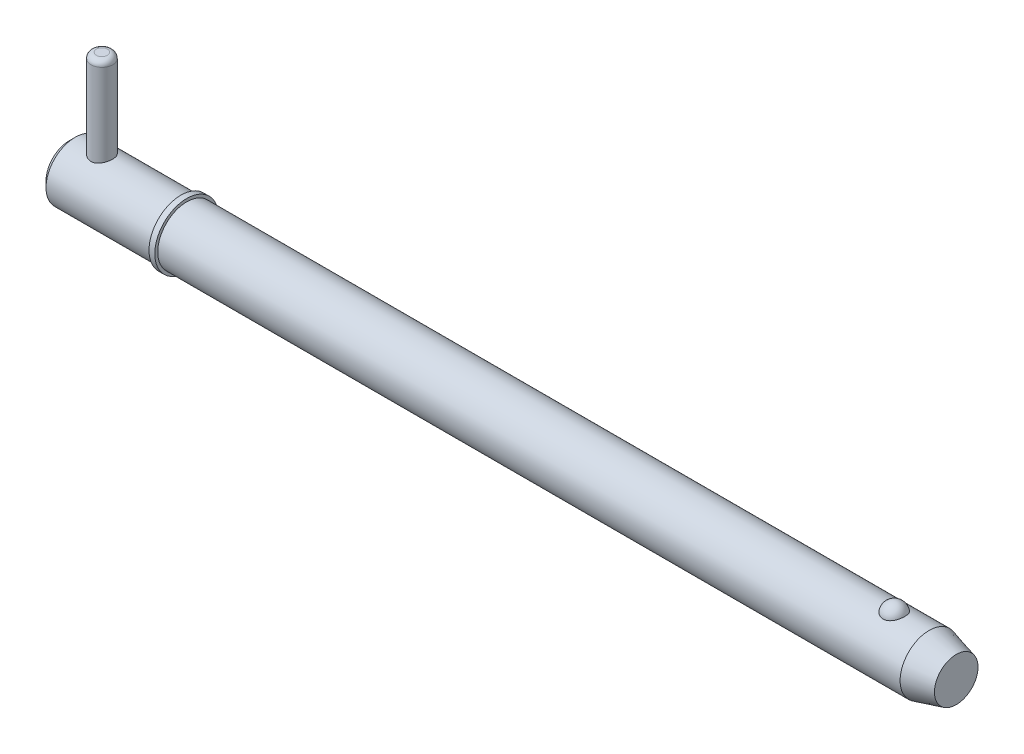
ISO-10303-21;
HEADER;
FILE_DESCRIPTION(('STEP AP214'),'2;1');
FILE_NAME('part.step','',(''),(''),'','','');
FILE_SCHEMA(('AUTOMOTIVE_DESIGN { 1 0 10303 214 1 1 1 1 }'));
ENDSEC;
DATA;
#1=APPLICATION_CONTEXT('core data for automotive mechanical design processes');
#2=APPLICATION_PROTOCOL_DEFINITION('international standard','automotive_design',2000,#1);
#3=PRODUCT_CONTEXT('',#1,'mechanical');
#4=PRODUCT('Part','Part','',(#3));
#5=PRODUCT_RELATED_PRODUCT_CATEGORY('part','',(#4));
#6=PRODUCT_DEFINITION_FORMATION('','',#4);
#7=PRODUCT_DEFINITION_CONTEXT('part definition',#1,'design');
#8=PRODUCT_DEFINITION('design','',#6,#7);
#9=PRODUCT_DEFINITION_SHAPE('','',#8);
#10=(LENGTH_UNIT() NAMED_UNIT(*) SI_UNIT(.MILLI.,.METRE.));
#11=(NAMED_UNIT(*) PLANE_ANGLE_UNIT() SI_UNIT($,.RADIAN.));
#12=(NAMED_UNIT(*) SI_UNIT($,.STERADIAN.) SOLID_ANGLE_UNIT());
#13=UNCERTAINTY_MEASURE_WITH_UNIT(LENGTH_MEASURE(1.E-05),#10,'distance_accuracy_value','');
#14=(GEOMETRIC_REPRESENTATION_CONTEXT(3) GLOBAL_UNCERTAINTY_ASSIGNED_CONTEXT((#13)) GLOBAL_UNIT_ASSIGNED_CONTEXT((#10,
#11,#12)) REPRESENTATION_CONTEXT('',''));
#15=CARTESIAN_POINT('',(0.,0.,0.));
#16=DIRECTION('',(0.,0.,1.));
#17=DIRECTION('',(1.,0.,0.));
#18=AXIS2_PLACEMENT_3D('',#15,#16,#17);
#19=CARTESIAN_POINT('',(7.14,25.4,0.));
#20=DIRECTION('',(0.,-1.,0.));
#21=DIRECTION('',(0.,0.,-1.));
#22=AXIS2_PLACEMENT_3D('',#19,#20,#21);
#23=CYLINDRICAL_SURFACE('',#22,2.38);
#24=CARTESIAN_POINT('',(7.14,-5.16,0.));
#25=DIRECTION('',(0.,1.,0.));
#26=DIRECTION('',(0.,0.,1.));
#27=AXIS2_PLACEMENT_3D('',#24,#25,#26);
#28=CIRCLE('',#27,2.38);
#29=CARTESIAN_POINT('',(7.14,-5.16,2.38));
#30=VERTEX_POINT('',#29);
#31=EDGE_CURVE('P0_E25',#30,#30,#28,.T.);
#32=ORIENTED_EDGE('',*,*,#31,.T.);
#33=EDGE_LOOP('',(#32));
#34=FACE_BOUND('',#33,.T.);
#35=CARTESIAN_POINT('',(7.14,24.21,0.));
#36=DIRECTION('',(0.,1.,0.));
#37=DIRECTION('',(0.,0.,1.));
#38=AXIS2_PLACEMENT_3D('',#35,#36,#37);
#39=CIRCLE('',#38,2.38);
#40=CARTESIAN_POINT('',(7.14,24.21,2.38));
#41=VERTEX_POINT('',#40);
#42=EDGE_CURVE('P0_E29',#41,#41,#39,.F.);
#43=ORIENTED_EDGE('',*,*,#42,.T.);
#44=EDGE_LOOP('',(#43));
#45=FACE_BOUND('',#44,.T.);
#46=ADVANCED_FACE('P0_F14',(#34,#45),#23,.T.);
#47=CARTESIAN_POINT('',(7.14,25.4,0.));
#48=DIRECTION('',(0.,1.,0.));
#49=DIRECTION('',(0.,0.,1.));
#50=AXIS2_PLACEMENT_3D('',#47,#48,#49);
#51=PLANE('',#50);
#52=CARTESIAN_POINT('',(7.14,25.4,0.));
#53=DIRECTION('',(0.,1.,0.));
#54=DIRECTION('',(0.,0.,1.));
#55=AXIS2_PLACEMENT_3D('',#52,#53,#54);
#56=CIRCLE('',#55,1.19);
#57=CARTESIAN_POINT('',(7.14,25.4,1.19));
#58=VERTEX_POINT('',#57);
#59=EDGE_CURVE('P0_E10',#58,#58,#56,.T.);
#60=ORIENTED_EDGE('',*,*,#59,.T.);
#61=EDGE_LOOP('',(#60));
#62=FACE_BOUND('',#61,.T.);
#63=ADVANCED_FACE('P0_F46',(#62),#51,.T.);
#64=CARTESIAN_POINT('',(7.14,-6.35,0.));
#65=DIRECTION('',(0.,1.,0.));
#66=DIRECTION('',(0.,0.,1.));
#67=AXIS2_PLACEMENT_3D('',#64,#65,#66);
#68=PLANE('',#67);
#69=CARTESIAN_POINT('',(7.14,-6.35,0.));
#70=DIRECTION('',(0.,1.,0.));
#71=DIRECTION('',(0.,0.,1.));
#72=AXIS2_PLACEMENT_3D('',#69,#70,#71);
#73=CIRCLE('',#72,1.19);
#74=CARTESIAN_POINT('',(7.14,-6.35,1.19));
#75=VERTEX_POINT('',#74);
#76=EDGE_CURVE('P0_E21',#75,#75,#73,.F.);
#77=ORIENTED_EDGE('',*,*,#76,.T.);
#78=EDGE_LOOP('',(#77));
#79=FACE_BOUND('',#78,.T.);
#80=ADVANCED_FACE('P0_F43',(#79),#68,.F.);
#81=CARTESIAN_POINT('',(7.14,-5.16,0.));
#82=DIRECTION('',(0.,1.,0.));
#83=DIRECTION('',(0.,0.,1.));
#84=AXIS2_PLACEMENT_3D('',#81,#82,#83);
#85=DEGENERATE_TOROIDAL_SURFACE('',#84,1.19,1.19,.T.);
#86=ORIENTED_EDGE('',*,*,#76,.F.);
#87=EDGE_LOOP('',(#86));
#88=FACE_BOUND('',#87,.T.);
#89=ORIENTED_EDGE('',*,*,#31,.F.);
#90=EDGE_LOOP('',(#89));
#91=FACE_BOUND('',#90,.T.);
#92=ADVANCED_FACE('P0_F38',(#88,#91),#85,.T.);
#93=CARTESIAN_POINT('',(7.14,24.21,0.));
#94=DIRECTION('',(0.,1.,0.));
#95=DIRECTION('',(0.,0.,1.));
#96=AXIS2_PLACEMENT_3D('',#93,#94,#95);
#97=DEGENERATE_TOROIDAL_SURFACE('',#96,1.19,1.19,.T.);
#98=ORIENTED_EDGE('',*,*,#42,.F.);
#99=EDGE_LOOP('',(#98));
#100=FACE_BOUND('',#99,.T.);
#101=ORIENTED_EDGE('',*,*,#59,.F.);
#102=EDGE_LOOP('',(#101));
#103=FACE_BOUND('',#102,.T.);
#104=ADVANCED_FACE('P0_F16',(#100,#103),#97,.T.);
#105=CLOSED_SHELL('',(#46,#63,#80,#92,#104));
#106=MANIFOLD_SOLID_BREP('P0_B1',#105);
#107=CARTESIAN_POINT('',(0.,0.,0.));
#108=DIRECTION('',(1.,0.,0.));
#109=DIRECTION('',(0.,0.,-1.));
#110=AXIS2_PLACEMENT_3D('',#107,#108,#109);
#111=CYLINDRICAL_SURFACE('',#110,6.35);
#112=CARTESIAN_POINT('',(188.055369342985,0.,0.));
#113=DIRECTION('',(1.,0.,0.));
#114=DIRECTION('',(0.,0.,-1.));
#115=AXIS2_PLACEMENT_3D('',#112,#113,#114);
#116=CIRCLE('',#115,6.35);
#117=CARTESIAN_POINT('',(188.055369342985,0.,-6.35));
#118=VERTEX_POINT('',#117);
#119=EDGE_CURVE('P1_E81',#118,#118,#116,.T.);
#120=ORIENTED_EDGE('',*,*,#119,.F.);
#121=EDGE_LOOP('',(#120));
#122=FACE_BOUND('',#121,.T.);
#123=CARTESIAN_POINT('',(25.7,0.,0.));
#124=DIRECTION('',(1.,0.,0.));
#125=DIRECTION('',(0.,0.,-1.));
#126=AXIS2_PLACEMENT_3D('',#123,#124,#125);
#127=CIRCLE('',#126,6.35);
#128=CARTESIAN_POINT('',(25.7,0.,-6.35));
#129=VERTEX_POINT('',#128);
#130=EDGE_CURVE('P1_E85',#129,#129,#127,.T.);
#131=ORIENTED_EDGE('',*,*,#130,.T.);
#132=EDGE_LOOP('',(#131));
#133=FACE_BOUND('',#132,.T.);
#134=CARTESIAN_POINT('',(180.430021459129,5.87502187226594,2.40969251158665));
#135=CARTESIAN_POINT('',(180.305030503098,5.87501645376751,2.40969773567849));
#136=CARTESIAN_POINT('',(180.180080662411,5.87916061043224,2.39967292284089));
#137=CARTESIAN_POINT('',(179.933909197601,5.89523112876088,2.35991730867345));
#138=CARTESIAN_POINT('',(179.812686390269,5.90715499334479,2.33019283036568));
#139=CARTESIAN_POINT('',(179.577517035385,5.93739567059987,2.25201402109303));
#140=CARTESIAN_POINT('',(179.463560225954,5.95570321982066,2.20358681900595));
#141=CARTESIAN_POINT('',(179.24557352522,5.9967206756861,2.08937987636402));
#142=CARTESIAN_POINT('',(179.141545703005,6.0194314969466,2.02359652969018));
#143=CARTESIAN_POINT('',(178.942943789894,6.06760647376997,1.87428969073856));
#144=CARTESIAN_POINT('',(178.848726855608,6.09313095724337,1.79031110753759));
#145=CARTESIAN_POINT('',(178.675255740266,6.14375873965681,1.60800178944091));
#146=CARTESIAN_POINT('',(178.596004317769,6.16886196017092,1.50966841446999));
#147=CARTESIAN_POINT('',(178.450845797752,6.21724600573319,1.29645884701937));
#148=CARTESIAN_POINT('',(178.385688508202,6.24039621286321,1.1810415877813));
#149=CARTESIAN_POINT('',(178.274703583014,6.28117277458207,0.940351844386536));
#150=CARTESIAN_POINT('',(178.228877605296,6.29879865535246,0.815078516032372));
#151=CARTESIAN_POINT('',(178.157023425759,6.32692073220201,0.556494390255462));
#152=CARTESIAN_POINT('',(178.131249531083,6.33732517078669,0.423102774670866));
#153=CARTESIAN_POINT('',(178.100988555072,6.34957673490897,0.153542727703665));
#154=CARTESIAN_POINT('',(178.096500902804,6.35142408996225,0.0173743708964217));
#155=CARTESIAN_POINT('',(178.108865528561,6.34638925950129,-0.25303667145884));
#156=CARTESIAN_POINT('',(178.125594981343,6.33955731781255,-0.387285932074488));
#157=CARTESIAN_POINT('',(178.179843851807,6.31794129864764,-0.650851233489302));
#158=CARTESIAN_POINT('',(178.217363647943,6.3031570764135,-0.780167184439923));
#159=CARTESIAN_POINT('',(178.312500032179,6.26711642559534,-1.03041949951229));
#160=CARTESIAN_POINT('',(178.370143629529,6.24585130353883,-1.15134433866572));
#161=CARTESIAN_POINT('',(178.504352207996,6.19905619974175,-1.38129800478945));
#162=CARTESIAN_POINT('',(178.580918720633,6.17352587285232,-1.49032586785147));
#163=CARTESIAN_POINT('',(178.751753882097,6.12080227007,-1.69393164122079));
#164=CARTESIAN_POINT('',(178.846100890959,6.09360200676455,-1.78844209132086));
#165=CARTESIAN_POINT('',(179.050119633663,6.04070434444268,-1.95970536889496));
#166=CARTESIAN_POINT('',(179.159790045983,6.015006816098,-2.0364597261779));
#167=CARTESIAN_POINT('',(179.389187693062,5.96867714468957,-2.16845644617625));
#168=CARTESIAN_POINT('',(179.508652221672,5.94794910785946,-2.22412062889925));
#169=CARTESIAN_POINT('',(179.756218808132,5.91340580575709,-2.31440992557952));
#170=CARTESIAN_POINT('',(179.884317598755,5.89958794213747,-2.34904294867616));
#171=CARTESIAN_POINT('',(180.138582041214,5.88111049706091,-2.39491590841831));
#172=CARTESIAN_POINT('',(180.264520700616,5.87602512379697,-2.40724512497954));
#173=CARTESIAN_POINT('',(180.516786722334,5.87428980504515,-2.41147867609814));
#174=CARTESIAN_POINT('',(180.643114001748,5.8776381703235,-2.40338710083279));
#175=CARTESIAN_POINT('',(180.888417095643,5.89212921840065,-2.36762715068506));
#176=CARTESIAN_POINT('',(181.007499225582,5.90302431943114,-2.3405803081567));
#177=CARTESIAN_POINT('',(181.23924472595,5.93113752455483,-2.26839066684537));
#178=CARTESIAN_POINT('',(181.351907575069,5.94835614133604,-2.22324640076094));
#179=CARTESIAN_POINT('',(181.570400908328,5.9877301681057,-2.11493806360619));
#180=CARTESIAN_POINT('',(181.676028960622,6.00998499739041,-2.05140269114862));
#181=CARTESIAN_POINT('',(181.875300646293,6.05690144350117,-1.90842705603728));
#182=CARTESIAN_POINT('',(181.968941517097,6.08156361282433,-1.82898313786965));
#183=CARTESIAN_POINT('',(182.146675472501,6.13211715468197,-1.65182429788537));
#184=CARTESIAN_POINT('',(182.230055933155,6.15800825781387,-1.55339381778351));
#185=CARTESIAN_POINT('',(182.379790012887,6.20712834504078,-1.34374214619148));
#186=CARTESIAN_POINT('',(182.446140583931,6.23035685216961,-1.23251867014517));
#187=CARTESIAN_POINT('',(182.562345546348,6.27251177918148,-0.996447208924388));
#188=CARTESIAN_POINT('',(182.611607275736,6.29127762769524,-0.871278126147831));
#189=CARTESIAN_POINT('',(182.689614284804,6.3215862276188,-0.613870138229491));
#190=CARTESIAN_POINT('',(182.718359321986,6.33312889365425,-0.481631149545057));
#191=CARTESIAN_POINT('',(182.754770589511,6.34782349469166,-0.213672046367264));
#192=CARTESIAN_POINT('',(182.762413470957,6.35096613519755,-0.0779482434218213));
#193=CARTESIAN_POINT('',(182.756395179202,6.34851322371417,0.192943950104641));
#194=CARTESIAN_POINT('',(182.742734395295,6.3429178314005,0.328112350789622));
#195=CARTESIAN_POINT('',(182.69450361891,6.32360512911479,0.593406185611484));
#196=CARTESIAN_POINT('',(182.660031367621,6.30992579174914,0.723552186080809));
#197=CARTESIAN_POINT('',(182.570953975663,6.27586325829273,0.97583417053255));
#198=CARTESIAN_POINT('',(182.51634761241,6.25547965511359,1.09796966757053));
#199=CARTESIAN_POINT('',(182.38775879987,6.20998183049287,1.33148921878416));
#200=CARTESIAN_POINT('',(182.313674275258,6.18484288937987,1.44281227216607));
#201=CARTESIAN_POINT('',(182.147820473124,6.13258735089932,1.65087683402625));
#202=CARTESIAN_POINT('',(182.056051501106,6.10547078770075,1.7476185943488));
#203=CARTESIAN_POINT('',(181.857183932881,6.05235879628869,1.92350926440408));
#204=CARTESIAN_POINT('',(181.750133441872,6.02636017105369,2.00271146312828));
#205=CARTESIAN_POINT('',(181.523138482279,5.97843747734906,2.14154159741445));
#206=CARTESIAN_POINT('',(181.403191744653,5.9565141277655,2.20116608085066));
#207=CARTESIAN_POINT('',(181.144523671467,5.91812106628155,2.30250570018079));
#208=CARTESIAN_POINT('',(181.00506980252,5.90217533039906,2.34256795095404));
#209=CARTESIAN_POINT('',(180.720397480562,5.88063128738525,2.3961521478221));
#210=CARTESIAN_POINT('',(180.57518174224,5.87502816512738,2.40968644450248));
#211=CARTESIAN_POINT('',(180.430021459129,5.87502187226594,2.40969251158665));
#212=B_SPLINE_CURVE_WITH_KNOTS('',3,(#134,#135,#136,#137,#138,#139,#140,#141,#142,#143,#144,
#145,#146,#147,#148,#149,#150,#151,#152,#153,#154,#155,#156,#157,#158,#159,#160,#161,#162,#163,
#164,#165,#166,#167,#168,#169,#170,#171,#172,#173,#174,#175,#176,#177,#178,#179,#180,#181,#182,
#183,#184,#185,#186,#187,#188,#189,#190,#191,#192,#193,#194,#195,#196,#197,#198,#199,#200,#201,
#202,#203,#204,#205,#206,#207,#208,#209,#210,#211),.UNSPECIFIED.,.T.,.F.,(4,2,2,2,2,2,2,2,2,2,2,
2,2,2,2,2,2,2,2,2,2,2,2,2,2,2,2,2,2,2,2,2,2,2,2,2,2,2,4),(0.,0.374440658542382,
0.748761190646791,1.12254078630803,1.4963981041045,1.88098871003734,2.26565013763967,
2.66741104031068,3.06920639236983,3.47601794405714,3.88281858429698,4.28727498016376,
4.69173873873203,5.09674745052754,5.50178895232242,5.90865911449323,6.31549420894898,
6.71369855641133,7.11175305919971,7.48978077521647,7.86773278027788,8.23383886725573,
8.59997464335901,8.97409044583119,9.34829231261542,9.74122667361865,10.1342313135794,
10.5397522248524,10.9452779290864,11.3512521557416,11.75721896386,12.1612938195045,
12.5653932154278,12.9716540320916,13.3779078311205,13.7829098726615,14.1879832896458,
14.6230486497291,15.0579114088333),.UNSPECIFIED.);
#213=CARTESIAN_POINT('',(180.430021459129,5.87502187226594,2.40969251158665));
#214=VERTEX_POINT('',#213);
#215=EDGE_CURVE('P1_E35',#214,#214,#212,.T.);
#216=ORIENTED_EDGE('',*,*,#215,.T.);
#217=EDGE_LOOP('',(#216));
#218=FACE_BOUND('',#217,.T.);
#219=ADVANCED_FACE('P1_F13',(#122,#133,#218),#111,.T.);
#220=CARTESIAN_POINT('',(0.,0.,0.));
#221=DIRECTION('',(-1.,0.,0.));
#222=DIRECTION('',(0.,0.,1.));
#223=AXIS2_PLACEMENT_3D('',#220,#221,#222);
#224=PLANE('',#223);
#225=CARTESIAN_POINT('',(0.,0.,0.));
#226=DIRECTION('',(1.,0.,0.));
#227=DIRECTION('',(0.,0.,-1.));
#228=AXIS2_PLACEMENT_3D('',#225,#226,#227);
#229=CIRCLE('',#228,5.08);
#230=CARTESIAN_POINT('',(0.,0.,-5.08));
#231=VERTEX_POINT('',#230);
#232=EDGE_CURVE('P1_E9',#231,#231,#229,.T.);
#233=ORIENTED_EDGE('',*,*,#232,.F.);
#234=EDGE_LOOP('',(#233));
#235=FACE_BOUND('',#234,.T.);
#236=ADVANCED_FACE('P1_F15',(#235),#224,.T.);
#237=CARTESIAN_POINT('',(1.27,0.,0.));
#238=DIRECTION('',(1.,0.,0.));
#239=DIRECTION('',(0.,0.,-1.));
#240=AXIS2_PLACEMENT_3D('',#237,#238,#239);
#241=CONICAL_SURFACE('',#240,6.35,0.78539816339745);
#242=ORIENTED_EDGE('',*,*,#232,.T.);
#243=EDGE_LOOP('',(#242));
#244=FACE_BOUND('',#243,.T.);
#245=CARTESIAN_POINT('',(1.27,0.,0.));
#246=DIRECTION('',(1.,0.,0.));
#247=DIRECTION('',(0.,0.,-1.));
#248=AXIS2_PLACEMENT_3D('',#245,#246,#247);
#249=CIRCLE('',#248,6.35);
#250=CARTESIAN_POINT('',(1.27,0.,-6.35));
#251=VERTEX_POINT('',#250);
#252=EDGE_CURVE('P1_E26',#251,#251,#249,.T.);
#253=ORIENTED_EDGE('',*,*,#252,.F.);
#254=EDGE_LOOP('',(#253));
#255=FACE_BOUND('',#254,.T.);
#256=ADVANCED_FACE('P1_F77',(#244,#255),#241,.T.);
#257=CARTESIAN_POINT('',(0.,0.,0.));
#258=DIRECTION('',(1.,0.,0.));
#259=DIRECTION('',(0.,0.,-1.));
#260=AXIS2_PLACEMENT_3D('',#257,#258,#259);
#261=CYLINDRICAL_SURFACE('',#260,6.35);
#262=CARTESIAN_POINT('',(7.14,-5.88711304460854,2.38));
#263=CARTESIAN_POINT('',(7.01146258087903,-5.88710856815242,2.38000480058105));
#264=CARTESIAN_POINT('',(6.88295682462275,-5.89136840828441,2.36955244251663));
#265=CARTESIAN_POINT('',(6.62981934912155,-5.90782785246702,2.32820953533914));
#266=CARTESIAN_POINT('',(6.50518751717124,-5.92002722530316,2.29731958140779));
#267=CARTESIAN_POINT('',(6.26352403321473,-5.95079384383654,2.21639366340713));
#268=CARTESIAN_POINT('',(6.14647496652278,-5.96934583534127,2.16640353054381));
#269=CARTESIAN_POINT('',(5.92237941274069,-6.01070278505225,2.04885862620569));
#270=CARTESIAN_POINT('',(5.81533593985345,-6.03350901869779,1.98129858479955));
#271=CARTESIAN_POINT('',(5.60897525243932,-6.08207341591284,1.82693902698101));
#272=CARTESIAN_POINT('',(5.51022503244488,-6.10791836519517,1.73940861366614));
#273=CARTESIAN_POINT('',(5.32840561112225,-6.15892405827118,1.54914379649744));
#274=CARTESIAN_POINT('',(5.24533975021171,-6.1840846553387,1.44640616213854));
#275=CARTESIAN_POINT('',(5.09451639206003,-6.23191821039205,1.22434014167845));
#276=CARTESIAN_POINT('',(5.02737511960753,-6.25447755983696,1.10456656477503));
#277=CARTESIAN_POINT('',(4.91443001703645,-6.2935236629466,0.854429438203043));
#278=CARTESIAN_POINT('',(4.86861879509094,-6.31001251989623,0.724069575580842));
#279=CARTESIAN_POINT('',(4.80162253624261,-6.33444370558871,0.46242122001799));
#280=CARTESIAN_POINT('',(4.77946137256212,-6.34272370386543,0.331414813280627));
#281=CARTESIAN_POINT('',(4.75726677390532,-6.35101600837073,0.0672982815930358));
#282=CARTESIAN_POINT('',(4.75722615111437,-6.35103100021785,-0.0658111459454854));
#283=CARTESIAN_POINT('',(4.77870510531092,-6.3430064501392,-0.323358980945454));
#284=CARTESIAN_POINT('',(4.79915922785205,-6.33536494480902,-0.447900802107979));
#285=CARTESIAN_POINT('',(4.85925493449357,-6.31340794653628,-0.69163609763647));
#286=CARTESIAN_POINT('',(4.89889787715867,-6.29909198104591,-0.810829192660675));
#287=CARTESIAN_POINT('',(4.9967414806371,-6.26494471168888,-1.04254212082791));
#288=CARTESIAN_POINT('',(5.05520370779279,-6.24503620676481,-1.1549396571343));
#289=CARTESIAN_POINT('',(5.1887948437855,-6.20171869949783,-1.3686079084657));
#290=CARTESIAN_POINT('',(5.26392912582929,-6.17830856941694,-1.46987502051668));
#291=CARTESIAN_POINT('',(5.43386591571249,-6.12878580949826,-1.66468415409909));
#292=CARTESIAN_POINT('',(5.52956139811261,-6.10259519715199,-1.75742857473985));
#293=CARTESIAN_POINT('',(5.73530435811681,-6.05155777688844,-1.92585331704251));
#294=CARTESIAN_POINT('',(5.84535542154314,-6.02671130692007,-2.00152936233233));
#295=CARTESIAN_POINT('',(6.07982989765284,-5.98068420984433,-2.13519109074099));
#296=CARTESIAN_POINT('',(6.20451768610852,-5.95959698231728,-2.19274775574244));
#297=CARTESIAN_POINT('',(6.4628145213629,-5.92455622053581,-2.28574558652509));
#298=CARTESIAN_POINT('',(6.59641856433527,-5.91059872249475,-2.32119904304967));
#299=CARTESIAN_POINT('',(6.86087441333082,-5.8923327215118,-2.36717069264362));
#300=CARTESIAN_POINT('',(6.99147192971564,-5.8875347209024,-2.37895573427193));
#301=CARTESIAN_POINT('',(7.25283805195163,-5.88674545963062,-2.38091046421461));
#302=CARTESIAN_POINT('',(7.38360660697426,-5.89075200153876,-2.37108554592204));
#303=CARTESIAN_POINT('',(7.63510696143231,-5.90662331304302,-2.33124781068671));
#304=CARTESIAN_POINT('',(7.75602069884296,-5.91810660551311,-2.30221396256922));
#305=CARTESIAN_POINT('',(7.99120505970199,-5.94718527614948,-2.22601401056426));
#306=CARTESIAN_POINT('',(8.10547431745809,-5.96478190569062,-2.17884419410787));
#307=CARTESIAN_POINT('',(8.32888632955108,-6.00491533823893,-2.06572311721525));
#308=CARTESIAN_POINT('',(8.43767672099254,-6.02761250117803,-1.99913452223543));
#309=CARTESIAN_POINT('',(8.6429894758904,-6.07511988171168,-1.84974438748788));
#310=CARTESIAN_POINT('',(8.73950733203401,-6.09993087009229,-1.76693691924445));
#311=CARTESIAN_POINT('',(8.9238741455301,-6.1507686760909,-1.58125563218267));
#312=CARTESIAN_POINT('',(9.01078732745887,-6.17677301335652,-1.47744327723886));
#313=CARTESIAN_POINT('',(9.16607127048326,-6.22556172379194,-1.25606967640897));
#314=CARTESIAN_POINT('',(9.23444197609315,-6.24834608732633,-1.13850838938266));
#315=CARTESIAN_POINT('',(9.3502493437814,-6.28811144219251,-0.893050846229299));
#316=CARTESIAN_POINT('',(9.39775808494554,-6.30511236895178,-0.765192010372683));
#317=CARTESIAN_POINT('',(9.47032640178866,-6.33145833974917,-0.502514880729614));
#318=CARTESIAN_POINT('',(9.49539651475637,-6.34080697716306,-0.367699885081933));
#319=CARTESIAN_POINT('',(9.52124059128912,-6.35045496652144,-0.103396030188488));
#320=CARTESIAN_POINT('',(9.52334421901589,-6.35124952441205,0.025945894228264));
#321=CARTESIAN_POINT('',(9.50661518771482,-6.34499064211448,0.283061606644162));
#322=CARTESIAN_POINT('',(9.48778504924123,-6.33793814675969,0.410835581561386));
#323=CARTESIAN_POINT('',(9.43065630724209,-6.31700307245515,0.658028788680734));
#324=CARTESIAN_POINT('',(9.39284291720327,-6.30329098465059,0.7775756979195));
#325=CARTESIAN_POINT('',(9.29930406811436,-6.27046903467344,1.00863789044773));
#326=CARTESIAN_POINT('',(9.2435752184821,-6.25135815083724,1.12015164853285));
#327=CARTESIAN_POINT('',(9.11312349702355,-6.20865254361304,1.33711407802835));
#328=CARTESIAN_POINT('',(9.03770094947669,-6.18490316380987,1.44211105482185));
#329=CARTESIAN_POINT('',(8.87110640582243,-6.13583718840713,1.63836897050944));
#330=CARTESIAN_POINT('',(8.77992879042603,-6.11052003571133,1.72962498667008));
#331=CARTESIAN_POINT('',(8.57869799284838,-6.05953829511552,1.90076098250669));
#332=CARTESIAN_POINT('',(8.46790320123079,-6.03392573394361,1.97978778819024));
#333=CARTESIAN_POINT('',(8.23379693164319,-5.98676607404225,2.11813466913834));
#334=CARTESIAN_POINT('',(8.11048418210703,-5.9652193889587,2.17745273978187));
#335=CARTESIAN_POINT('',(7.84900037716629,-5.92818393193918,2.27641807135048));
#336=CARTESIAN_POINT('',(7.71041678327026,-5.91299857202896,2.31510015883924));
#337=CARTESIAN_POINT('',(7.42787316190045,-5.89246887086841,2.36688002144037));
#338=CARTESIAN_POINT('',(7.28391673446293,-5.88711805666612,2.37999462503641));
#339=CARTESIAN_POINT('',(7.14,-5.88711304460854,2.38));
#340=B_SPLINE_CURVE_WITH_KNOTS('',3,(#262,#263,#264,#265,#266,#267,#268,#269,#270,#271,#272,
#273,#274,#275,#276,#277,#278,#279,#280,#281,#282,#283,#284,#285,#286,#287,#288,#289,#290,#291,
#292,#293,#294,#295,#296,#297,#298,#299,#300,#301,#302,#303,#304,#305,#306,#307,#308,#309,#310,
#311,#312,#313,#314,#315,#316,#317,#318,#319,#320,#321,#322,#323,#324,#325,#326,#327,#328,#329,
#330,#331,#332,#333,#334,#335,#336,#337,#338,#339),.UNSPECIFIED.,.T.,.F.,(4,2,2,2,2,2,2,2,2,2,2,
2,2,2,2,2,2,2,2,2,2,2,2,2,2,2,2,2,2,2,2,2,2,2,2,2,2,2,4),(0.,0.385076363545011,
0.770141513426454,1.15428843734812,1.53855071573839,1.94016118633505,2.3418570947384,
2.75720522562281,3.1724093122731,3.569721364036,3.96690431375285,4.34445758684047,
4.72203759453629,5.10511017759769,5.48830640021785,5.89390240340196,6.29959991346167,
6.71428455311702,7.12873839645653,7.52034494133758,7.91185376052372,8.28480528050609,
8.65783318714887,9.0448340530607,9.43197664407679,9.84363087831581,10.2552863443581,
10.6655081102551,11.0755371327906,11.4616919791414,11.847800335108,12.224507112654,
12.6012852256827,12.9938941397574,13.386643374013,13.8000944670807,14.2135876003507,
14.6450218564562,15.0761720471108),.UNSPECIFIED.);
#341=CARTESIAN_POINT('',(7.14,-5.88711304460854,2.38));
#342=VERTEX_POINT('',#341);
#343=EDGE_CURVE('P1_E17',#342,#342,#340,.T.);
#344=ORIENTED_EDGE('',*,*,#343,.F.);
#345=EDGE_LOOP('',(#344));
#346=FACE_BOUND('',#345,.T.);
#347=CARTESIAN_POINT('',(7.14,5.88711304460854,2.38));
#348=CARTESIAN_POINT('',(7.26853741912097,5.88710856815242,2.38000480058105));
#349=CARTESIAN_POINT('',(7.39704317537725,5.89136840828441,2.36955244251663));
#350=CARTESIAN_POINT('',(7.65018065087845,5.90782785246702,2.32820953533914));
#351=CARTESIAN_POINT('',(7.77481248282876,5.92002722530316,2.29731958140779));
#352=CARTESIAN_POINT('',(8.01647596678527,5.95079384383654,2.21639366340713));
#353=CARTESIAN_POINT('',(8.13352503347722,5.96934583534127,2.16640353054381));
#354=CARTESIAN_POINT('',(8.35762058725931,6.01070278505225,2.04885862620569));
#355=CARTESIAN_POINT('',(8.46466406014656,6.03350901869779,1.98129858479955));
#356=CARTESIAN_POINT('',(8.67102474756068,6.08207341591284,1.82693902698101));
#357=CARTESIAN_POINT('',(8.76977496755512,6.10791836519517,1.73940861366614));
#358=CARTESIAN_POINT('',(8.95159438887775,6.15892405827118,1.54914379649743));
#359=CARTESIAN_POINT('',(9.03466024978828,6.1840846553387,1.44640616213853));
#360=CARTESIAN_POINT('',(9.18548360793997,6.23191821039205,1.22434014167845));
#361=CARTESIAN_POINT('',(9.25262488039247,6.25447755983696,1.10456656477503));
#362=CARTESIAN_POINT('',(9.36556998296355,6.2935236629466,0.854429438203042));
#363=CARTESIAN_POINT('',(9.41138120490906,6.31001251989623,0.72406957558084));
#364=CARTESIAN_POINT('',(9.47837746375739,6.33444370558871,0.462421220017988));
#365=CARTESIAN_POINT('',(9.50053862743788,6.34272370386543,0.331414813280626));
#366=CARTESIAN_POINT('',(9.52273322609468,6.35101600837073,0.0672982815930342));
#367=CARTESIAN_POINT('',(9.52277384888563,6.35103100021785,-0.0658111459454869));
#368=CARTESIAN_POINT('',(9.50129489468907,6.3430064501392,-0.323358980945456));
#369=CARTESIAN_POINT('',(9.48084077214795,6.33536494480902,-0.447900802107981));
#370=CARTESIAN_POINT('',(9.42074506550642,6.31340794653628,-0.691636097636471));
#371=CARTESIAN_POINT('',(9.38110212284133,6.29909198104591,-0.810829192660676));
#372=CARTESIAN_POINT('',(9.2832585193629,6.26494471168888,-1.04254212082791));
#373=CARTESIAN_POINT('',(9.22479629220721,6.24503620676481,-1.1549396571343));
#374=CARTESIAN_POINT('',(9.0912051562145,6.20171869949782,-1.3686079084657));
#375=CARTESIAN_POINT('',(9.0160708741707,6.17830856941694,-1.46987502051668));
#376=CARTESIAN_POINT('',(8.84613408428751,6.12878580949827,-1.66468415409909));
#377=CARTESIAN_POINT('',(8.75043860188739,6.10259519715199,-1.75742857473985));
#378=CARTESIAN_POINT('',(8.54469564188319,6.05155777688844,-1.92585331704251));
#379=CARTESIAN_POINT('',(8.43464457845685,6.02671130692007,-2.00152936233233));
#380=CARTESIAN_POINT('',(8.20017010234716,5.98068420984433,-2.13519109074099));
#381=CARTESIAN_POINT('',(8.07548231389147,5.95959698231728,-2.19274775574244));
#382=CARTESIAN_POINT('',(7.8171854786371,5.9245562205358,-2.28574558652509));
#383=CARTESIAN_POINT('',(7.68358143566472,5.91059872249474,-2.32119904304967));
#384=CARTESIAN_POINT('',(7.41912558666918,5.8923327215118,-2.36717069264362));
#385=CARTESIAN_POINT('',(7.28852807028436,5.8875347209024,-2.37895573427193));
#386=CARTESIAN_POINT('',(7.02716194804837,5.88674545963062,-2.38091046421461));
#387=CARTESIAN_POINT('',(6.89639339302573,5.89075200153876,-2.37108554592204));
#388=CARTESIAN_POINT('',(6.64489303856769,5.90662331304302,-2.33124781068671));
#389=CARTESIAN_POINT('',(6.52397930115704,5.91810660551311,-2.30221396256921));
#390=CARTESIAN_POINT('',(6.288794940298,5.94718527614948,-2.22601401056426));
#391=CARTESIAN_POINT('',(6.17452568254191,5.96478190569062,-2.17884419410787));
#392=CARTESIAN_POINT('',(5.95111367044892,6.00491533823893,-2.06572311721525));
#393=CARTESIAN_POINT('',(5.84232327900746,6.02761250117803,-1.99913452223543));
#394=CARTESIAN_POINT('',(5.6370105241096,6.07511988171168,-1.84974438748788));
#395=CARTESIAN_POINT('',(5.54049266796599,6.09993087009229,-1.76693691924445));
#396=CARTESIAN_POINT('',(5.3561258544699,6.1507686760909,-1.58125563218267));
#397=CARTESIAN_POINT('',(5.26921267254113,6.17677301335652,-1.47744327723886));
#398=CARTESIAN_POINT('',(5.11392872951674,6.22556172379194,-1.25606967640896));
#399=CARTESIAN_POINT('',(5.04555802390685,6.24834608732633,-1.13850838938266));
#400=CARTESIAN_POINT('',(4.9297506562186,6.28811144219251,-0.893050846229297));
#401=CARTESIAN_POINT('',(4.88224191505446,6.30511236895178,-0.76519201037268));
#402=CARTESIAN_POINT('',(4.80967359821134,6.33145833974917,-0.502514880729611));
#403=CARTESIAN_POINT('',(4.78460348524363,6.34080697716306,-0.36769988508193));
#404=CARTESIAN_POINT('',(4.75875940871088,6.35045496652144,-0.103396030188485));
#405=CARTESIAN_POINT('',(4.75665578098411,6.35124952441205,0.025945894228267));
#406=CARTESIAN_POINT('',(4.77338481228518,6.34499064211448,0.283061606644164));
#407=CARTESIAN_POINT('',(4.79221495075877,6.33793814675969,0.410835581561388));
#408=CARTESIAN_POINT('',(4.84934369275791,6.31700307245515,0.658028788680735));
#409=CARTESIAN_POINT('',(4.88715708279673,6.30329098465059,0.777575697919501));
#410=CARTESIAN_POINT('',(4.98069593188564,6.27046903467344,1.00863789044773));
#411=CARTESIAN_POINT('',(5.0364247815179,6.25135815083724,1.12015164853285));
#412=CARTESIAN_POINT('',(5.16687650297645,6.20865254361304,1.33711407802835));
#413=CARTESIAN_POINT('',(5.24229905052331,6.18490316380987,1.44211105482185));
#414=CARTESIAN_POINT('',(5.40889359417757,6.13583718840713,1.63836897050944));
#415=CARTESIAN_POINT('',(5.50007120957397,6.11052003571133,1.72962498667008));
#416=CARTESIAN_POINT('',(5.70130200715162,6.05953829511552,1.90076098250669));
#417=CARTESIAN_POINT('',(5.81209679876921,6.03392573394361,1.97978778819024));
#418=CARTESIAN_POINT('',(6.04620306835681,5.98676607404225,2.11813466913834));
#419=CARTESIAN_POINT('',(6.16951581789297,5.9652193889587,2.17745273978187));
#420=CARTESIAN_POINT('',(6.43099962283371,5.92818393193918,2.27641807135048));
#421=CARTESIAN_POINT('',(6.56958321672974,5.91299857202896,2.31510015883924));
#422=CARTESIAN_POINT('',(6.85212683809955,5.89246887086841,2.36688002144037));
#423=CARTESIAN_POINT('',(6.99608326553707,5.88711805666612,2.37999462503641));
#424=CARTESIAN_POINT('',(7.14,5.88711304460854,2.38));
#425=B_SPLINE_CURVE_WITH_KNOTS('',3,(#347,#348,#349,#350,#351,#352,#353,#354,#355,#356,#357,
#358,#359,#360,#361,#362,#363,#364,#365,#366,#367,#368,#369,#370,#371,#372,#373,#374,#375,#376,
#377,#378,#379,#380,#381,#382,#383,#384,#385,#386,#387,#388,#389,#390,#391,#392,#393,#394,#395,
#396,#397,#398,#399,#400,#401,#402,#403,#404,#405,#406,#407,#408,#409,#410,#411,#412,#413,#414,
#415,#416,#417,#418,#419,#420,#421,#422,#423,#424),.UNSPECIFIED.,.T.,.F.,(4,2,2,2,2,2,2,2,2,2,2,
2,2,2,2,2,2,2,2,2,2,2,2,2,2,2,2,2,2,2,2,2,2,2,2,2,2,2,4),(0.,0.385076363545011,
0.770141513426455,1.15428843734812,1.53855071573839,1.94016118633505,2.3418570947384,
2.75720522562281,3.1724093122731,3.56972136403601,3.96690431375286,4.34445758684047,
4.72203759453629,5.10511017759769,5.48830640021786,5.89390240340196,6.29959991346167,
6.71428455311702,7.12873839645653,7.52034494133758,7.91185376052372,8.2848052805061,
8.65783318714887,9.0448340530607,9.43197664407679,9.84363087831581,10.2552863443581,
10.6655081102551,11.0755371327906,11.4616919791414,11.847800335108,12.2245071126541,
12.6012852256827,12.9938941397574,13.386643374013,13.8000944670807,14.2135876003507,
14.6450218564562,15.0761720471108),.UNSPECIFIED.);
#426=CARTESIAN_POINT('',(7.14,5.88711304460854,2.38));
#427=VERTEX_POINT('',#426);
#428=EDGE_CURVE('P1_E43',#427,#427,#425,.T.);
#429=ORIENTED_EDGE('',*,*,#428,.F.);
#430=EDGE_LOOP('',(#429));
#431=FACE_BOUND('',#430,.T.);
#432=ORIENTED_EDGE('',*,*,#252,.T.);
#433=EDGE_LOOP('',(#432));
#434=FACE_BOUND('',#433,.T.);
#435=CARTESIAN_POINT('',(24.43,0.,0.));
#436=DIRECTION('',(1.,0.,0.));
#437=DIRECTION('',(0.,0.,-1.));
#438=AXIS2_PLACEMENT_3D('',#435,#436,#437);
#439=CIRCLE('',#438,6.35);
#440=CARTESIAN_POINT('',(24.43,0.,-6.35));
#441=VERTEX_POINT('',#440);
#442=EDGE_CURVE('P1_E31',#441,#441,#439,.T.);
#443=ORIENTED_EDGE('',*,*,#442,.F.);
#444=EDGE_LOOP('',(#443));
#445=FACE_BOUND('',#444,.T.);
#446=ADVANCED_FACE('P1_F103',(#346,#431,#434,#445),#261,.T.);
#447=CARTESIAN_POINT('',(24.43,6.35,0.));
#448=DIRECTION('',(-1.,0.,0.));
#449=DIRECTION('',(0.,0.,1.));
#450=AXIS2_PLACEMENT_3D('',#447,#448,#449);
#451=PLANE('',#450);
#452=ORIENTED_EDGE('',*,*,#442,.T.);
#453=EDGE_LOOP('',(#452));
#454=FACE_BOUND('',#453,.T.);
#455=CARTESIAN_POINT('',(24.43,0.,0.));
#456=DIRECTION('',(1.,0.,0.));
#457=DIRECTION('',(0.,0.,-1.));
#458=AXIS2_PLACEMENT_3D('',#455,#456,#457);
#459=CIRCLE('',#458,6.985);
#460=CARTESIAN_POINT('',(24.43,0.,-6.985));
#461=VERTEX_POINT('',#460);
#462=EDGE_CURVE('P1_E91',#461,#461,#459,.T.);
#463=ORIENTED_EDGE('',*,*,#462,.F.);
#464=EDGE_LOOP('',(#463));
#465=FACE_BOUND('',#464,.T.);
#466=ADVANCED_FACE('P1_F100',(#454,#465),#451,.T.);
#467=CARTESIAN_POINT('',(0.,0.,0.));
#468=DIRECTION('',(1.,0.,0.));
#469=DIRECTION('',(0.,0.,-1.));
#470=AXIS2_PLACEMENT_3D('',#467,#468,#469);
#471=CYLINDRICAL_SURFACE('',#470,6.985);
#472=ORIENTED_EDGE('',*,*,#462,.T.);
#473=EDGE_LOOP('',(#472));
#474=FACE_BOUND('',#473,.T.);
#475=CARTESIAN_POINT('',(25.7,0.,0.));
#476=DIRECTION('',(1.,0.,0.));
#477=DIRECTION('',(0.,0.,-1.));
#478=AXIS2_PLACEMENT_3D('',#475,#476,#477);
#479=CIRCLE('',#478,6.985);
#480=CARTESIAN_POINT('',(25.7,0.,-6.985));
#481=VERTEX_POINT('',#480);
#482=EDGE_CURVE('P1_E88',#481,#481,#479,.T.);
#483=ORIENTED_EDGE('',*,*,#482,.F.);
#484=EDGE_LOOP('',(#483));
#485=FACE_BOUND('',#484,.T.);
#486=ADVANCED_FACE('P1_F68',(#474,#485),#471,.T.);
#487=CARTESIAN_POINT('',(25.7,6.985,0.));
#488=DIRECTION('',(1.,0.,0.));
#489=DIRECTION('',(0.,0.,-1.));
#490=AXIS2_PLACEMENT_3D('',#487,#488,#489);
#491=PLANE('',#490);
#492=ORIENTED_EDGE('',*,*,#482,.T.);
#493=EDGE_LOOP('',(#492));
#494=FACE_BOUND('',#493,.T.);
#495=ORIENTED_EDGE('',*,*,#130,.F.);
#496=EDGE_LOOP('',(#495));
#497=FACE_BOUND('',#496,.T.);
#498=ADVANCED_FACE('P1_F62',(#494,#497),#491,.T.);
#499=CARTESIAN_POINT('',(193.98,0.,0.));
#500=DIRECTION('',(-1.,0.,0.));
#501=DIRECTION('',(0.,0.,1.));
#502=AXIS2_PLACEMENT_3D('',#499,#500,#501);
#503=CONICAL_SURFACE('',#502,4.76250000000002,0.26179938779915);
#504=ORIENTED_EDGE('',*,*,#119,.T.);
#505=EDGE_LOOP('',(#504));
#506=FACE_BOUND('',#505,.T.);
#507=CARTESIAN_POINT('',(193.98,0.,0.));
#508=DIRECTION('',(1.,0.,0.));
#509=DIRECTION('',(0.,0.,-1.));
#510=AXIS2_PLACEMENT_3D('',#507,#508,#509);
#511=CIRCLE('',#510,4.76250000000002);
#512=CARTESIAN_POINT('',(193.98,0.,-4.76250000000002));
#513=VERTEX_POINT('',#512);
#514=EDGE_CURVE('P1_E42',#513,#513,#511,.T.);
#515=ORIENTED_EDGE('',*,*,#514,.F.);
#516=EDGE_LOOP('',(#515));
#517=FACE_BOUND('',#516,.T.);
#518=ADVANCED_FACE('P1_F59',(#506,#517),#503,.T.);
#519=CARTESIAN_POINT('',(193.98,4.76250000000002,0.));
#520=DIRECTION('',(1.,0.,0.));
#521=DIRECTION('',(0.,0.,-1.));
#522=AXIS2_PLACEMENT_3D('',#519,#520,#521);
#523=PLANE('',#522);
#524=ORIENTED_EDGE('',*,*,#514,.T.);
#525=EDGE_LOOP('',(#524));
#526=FACE_BOUND('',#525,.T.);
#527=ADVANCED_FACE('P1_F55',(#526),#523,.T.);
#528=CARTESIAN_POINT('',(180.430021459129,5.715,0.));
#529=DIRECTION('',(-1.,0.,0.));
#530=DIRECTION('',(0.,1.,0.));
#531=AXIS2_PLACEMENT_3D('',#528,#529,#530);
#532=SPHERICAL_SURFACE('',#531,2.41500000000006);
#533=ORIENTED_EDGE('',*,*,#215,.F.);
#534=EDGE_LOOP('',(#533));
#535=FACE_BOUND('',#534,.T.);
#536=ADVANCED_FACE('P1_F50',(#535),#532,.T.);
#537=CARTESIAN_POINT('',(7.14,-6.985,0.));
#538=DIRECTION('',(0.,1.,0.));
#539=DIRECTION('',(0.,0.,1.));
#540=AXIS2_PLACEMENT_3D('',#537,#538,#539);
#541=CYLINDRICAL_SURFACE('',#540,2.38);
#542=ORIENTED_EDGE('',*,*,#343,.T.);
#543=EDGE_LOOP('',(#542));
#544=FACE_BOUND('',#543,.T.);
#545=ORIENTED_EDGE('',*,*,#428,.T.);
#546=EDGE_LOOP('',(#545));
#547=FACE_BOUND('',#546,.T.);
#548=ADVANCED_FACE('P1_F54',(#544,#547),#541,.F.);
#549=CLOSED_SHELL('',(#219,#236,#256,#446,#466,#486,#498,#518,#527,#536,#548));
#550=MANIFOLD_SOLID_BREP('P1_B1',#549);
#551=ADVANCED_BREP_SHAPE_REPRESENTATION('',(#18,#106,#550),#14);
#552=SHAPE_DEFINITION_REPRESENTATION(#9,#551);
ENDSEC;
END-ISO-10303-21;
